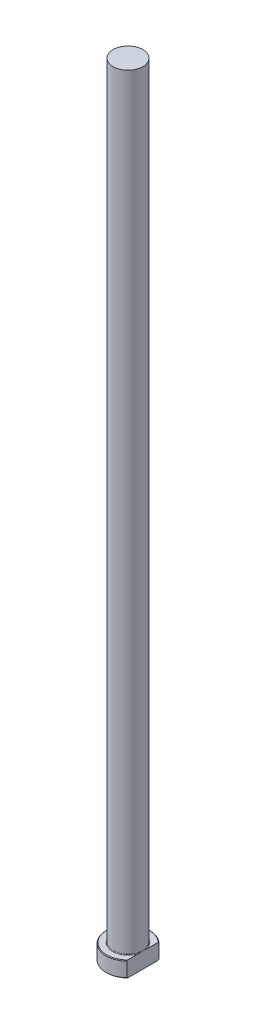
from build123d import *
from build123d.topology import SkipClean

# Parameters (mm, degrees)
CHAMFER1_SIZE = 0.2
FILLET1_R     = 0.2
KEY_DEPTH     = 251.195923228


with BuildPart() as part:
    # Sketch1 → Revolve1 (revolve)
    with BuildSketch(Plane.XY, mode=Mode.PRIVATE) as revolve1_sk:
        Polygon((0, 0), (-7, 0), (-7, 5), (-4.75, 5), (-4.75, 250), (0, 250), align=None)
    revolve(revolve1_sk.sketch.rotate(Axis((0, 259.958771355, 0), (0, -1, 0)), 270), axis=Axis((0, 259.958771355, 0), (0, -1, 0)))

    # Chamfer1
    chamfer1_edges = [part.edges().sort_by_distance(p)[0] for p in [
        (0, 5, -7),
        (0, 0, -7),
    ]]
    chamfer(chamfer1_edges, length=CHAMFER1_SIZE)

    # Fillet1
    fillet1_edges = [part.edges().sort_by_distance(p)[0] for p in [
        (0, 5, -4.75),
    ]]
    fillet(fillet1_edges, radius=FILLET1_R)

    # Sketch2 → KEY (cut, through all)
    with SkipClean():  # the faces are left unmerged after this step: merging them gives an invalid solid
        with BuildSketch(Plane(origin=(0, 0, 0), x_dir=(1, 0, 0), z_dir=(0, 1, 0))):
            with BuildLine():
                Line((4.75, 5.14174095), (4.75, -5.14174095))
                ThreePointArc((4.75, -5.14174095), (7, 0), (4.75, 5.14174095))
            make_face()
        extrude(amount=KEY_DEPTH, mode=Mode.SUBTRACT)


solid = part.part
